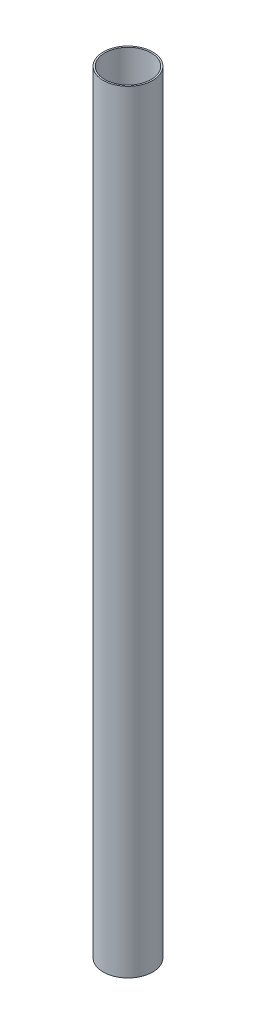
from build123d import *

# Parameters (mm, degrees)
SKETCH1_R           = 8
SKETCH1_R_2         = 7.5
BOSS_EXTRUDE1_DEPTH = 250


with BuildPart() as part:
    # Sketch1 → Boss-Extrude1 (new body)
    with BuildSketch(Plane(origin=(0, 0, 0), x_dir=(1, 0, 0), z_dir=(0, 1, 0))):
        with Locations(Location((0, 0, 0), (0, 0, 270))):
            Circle(SKETCH1_R)
        with Locations(Location((0, 0, 0), (0, 0, 270))):
            Circle(SKETCH1_R_2, mode=Mode.SUBTRACT)
    extrude(amount=BOSS_EXTRUDE1_DEPTH)


solid = part.part
